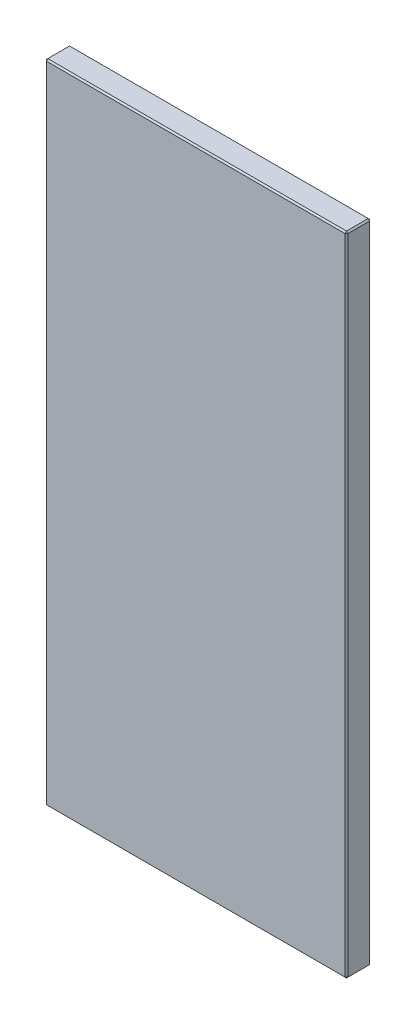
ISO-10303-21;
HEADER;
FILE_DESCRIPTION(('STEP AP214'),'2;1');
FILE_NAME('part.step','',(''),(''),'','','');
FILE_SCHEMA(('AUTOMOTIVE_DESIGN { 1 0 10303 214 1 1 1 1 }'));
ENDSEC;
DATA;
#1=APPLICATION_CONTEXT('core data for automotive mechanical design processes');
#2=APPLICATION_PROTOCOL_DEFINITION('international standard','automotive_design',2000,#1);
#3=PRODUCT_CONTEXT('',#1,'mechanical');
#4=PRODUCT('Part','Part','',(#3));
#5=PRODUCT_RELATED_PRODUCT_CATEGORY('part','',(#4));
#6=PRODUCT_DEFINITION_FORMATION('','',#4);
#7=PRODUCT_DEFINITION_CONTEXT('part definition',#1,'design');
#8=PRODUCT_DEFINITION('design','',#6,#7);
#9=PRODUCT_DEFINITION_SHAPE('','',#8);
#10=(LENGTH_UNIT() NAMED_UNIT(*) SI_UNIT(.MILLI.,.METRE.));
#11=(NAMED_UNIT(*) PLANE_ANGLE_UNIT() SI_UNIT($,.RADIAN.));
#12=(NAMED_UNIT(*) SI_UNIT($,.STERADIAN.) SOLID_ANGLE_UNIT());
#13=UNCERTAINTY_MEASURE_WITH_UNIT(LENGTH_MEASURE(1.E-05),#10,'distance_accuracy_value','');
#14=(GEOMETRIC_REPRESENTATION_CONTEXT(3) GLOBAL_UNCERTAINTY_ASSIGNED_CONTEXT((#13)) GLOBAL_UNIT_ASSIGNED_CONTEXT((#10,
#11,#12)) REPRESENTATION_CONTEXT('',''));
#15=CARTESIAN_POINT('',(0.,0.,0.));
#16=DIRECTION('',(0.,0.,1.));
#17=DIRECTION('',(1.,0.,0.));
#18=AXIS2_PLACEMENT_3D('',#15,#16,#17);
#19=CARTESIAN_POINT('',(-104.,-223.,17.));
#20=DIRECTION('',(1.,0.,0.));
#21=DIRECTION('',(0.,0.,-1.));
#22=AXIS2_PLACEMENT_3D('',#19,#20,#21);
#23=PLANE('',#22);
#24=DIRECTION('',(0.,0.,-1.));
#25=VECTOR('',#24,1.);
#26=CARTESIAN_POINT('',(-104.,222.,17.));
#27=LINE('',#26,#25);
#28=CARTESIAN_POINT('',(-104.,222.,16.));
#29=VERTEX_POINT('',#28);
#30=CARTESIAN_POINT('',(-104.,222.,1.));
#31=VERTEX_POINT('',#30);
#32=EDGE_CURVE('E114',#29,#31,#27,.T.);
#33=ORIENTED_EDGE('',*,*,#32,.T.);
#34=DIRECTION('',(0.,-1.,0.));
#35=VECTOR('',#34,1.);
#36=CARTESIAN_POINT('',(-104.,-223.,1.));
#37=LINE('',#36,#35);
#38=CARTESIAN_POINT('',(-104.,-222.,1.));
#39=VERTEX_POINT('',#38);
#40=EDGE_CURVE('E110',#31,#39,#37,.T.);
#41=ORIENTED_EDGE('',*,*,#40,.T.);
#42=DIRECTION('',(0.,0.,1.));
#43=VECTOR('',#42,1.);
#44=CARTESIAN_POINT('',(-104.,-222.,17.));
#45=LINE('',#44,#43);
#46=CARTESIAN_POINT('',(-104.,-222.,16.));
#47=VERTEX_POINT('',#46);
#48=EDGE_CURVE('E103',#39,#47,#45,.T.);
#49=ORIENTED_EDGE('',*,*,#48,.T.);
#50=DIRECTION('',(0.,1.,0.));
#51=VECTOR('',#50,1.);
#52=CARTESIAN_POINT('',(-104.,223.,16.));
#53=LINE('',#52,#51);
#54=EDGE_CURVE('E107',#47,#29,#53,.T.);
#55=ORIENTED_EDGE('',*,*,#54,.T.);
#56=EDGE_LOOP('',(#33,#41,#49,#55));
#57=FACE_BOUND('',#56,.T.);
#58=ADVANCED_FACE('F15',(#57),#23,.F.);
#59=CARTESIAN_POINT('',(104.,-223.,17.));
#60=DIRECTION('',(0.,1.,0.));
#61=DIRECTION('',(-1.,0.,0.));
#62=AXIS2_PLACEMENT_3D('',#59,#60,#61);
#63=PLANE('',#62);
#64=DIRECTION('',(0.,0.,-1.));
#65=VECTOR('',#64,1.);
#66=CARTESIAN_POINT('',(-103.,-223.,17.));
#67=LINE('',#66,#65);
#68=CARTESIAN_POINT('',(-103.,-223.,16.));
#69=VERTEX_POINT('',#68);
#70=CARTESIAN_POINT('',(-103.,-223.,1.));
#71=VERTEX_POINT('',#70);
#72=EDGE_CURVE('E122',#69,#71,#67,.T.);
#73=ORIENTED_EDGE('',*,*,#72,.T.);
#74=DIRECTION('',(1.,0.,0.));
#75=VECTOR('',#74,1.);
#76=CARTESIAN_POINT('',(104.,-223.,1.));
#77=LINE('',#76,#75);
#78=CARTESIAN_POINT('',(103.,-223.,1.));
#79=VERTEX_POINT('',#78);
#80=EDGE_CURVE('E160',#71,#79,#77,.T.);
#81=ORIENTED_EDGE('',*,*,#80,.T.);
#82=DIRECTION('',(0.,0.,1.));
#83=VECTOR('',#82,1.);
#84=CARTESIAN_POINT('',(103.,-223.,17.));
#85=LINE('',#84,#83);
#86=CARTESIAN_POINT('',(103.,-223.,16.));
#87=VERTEX_POINT('',#86);
#88=EDGE_CURVE('E157',#79,#87,#85,.T.);
#89=ORIENTED_EDGE('',*,*,#88,.T.);
#90=DIRECTION('',(-1.,0.,0.));
#91=VECTOR('',#90,1.);
#92=CARTESIAN_POINT('',(-104.,-223.,16.));
#93=LINE('',#92,#91);
#94=EDGE_CURVE('E155',#87,#69,#93,.T.);
#95=ORIENTED_EDGE('',*,*,#94,.T.);
#96=EDGE_LOOP('',(#73,#81,#89,#95));
#97=FACE_BOUND('',#96,.T.);
#98=ADVANCED_FACE('F277',(#97),#63,.F.);
#99=CARTESIAN_POINT('',(104.,-223.,17.));
#100=DIRECTION('',(-1.,0.,0.));
#101=DIRECTION('',(0.,0.,1.));
#102=AXIS2_PLACEMENT_3D('',#99,#100,#101);
#103=PLANE('',#102);
#104=DIRECTION('',(0.,-1.,0.));
#105=VECTOR('',#104,1.);
#106=CARTESIAN_POINT('',(104.,-223.,16.));
#107=LINE('',#106,#105);
#108=CARTESIAN_POINT('',(104.,222.,16.));
#109=VERTEX_POINT('',#108);
#110=CARTESIAN_POINT('',(104.,-222.,16.));
#111=VERTEX_POINT('',#110);
#112=EDGE_CURVE('E162',#109,#111,#107,.T.);
#113=ORIENTED_EDGE('',*,*,#112,.T.);
#114=DIRECTION('',(0.,0.,-1.));
#115=VECTOR('',#114,1.);
#116=CARTESIAN_POINT('',(104.,-222.,17.));
#117=LINE('',#116,#115);
#118=CARTESIAN_POINT('',(104.,-222.,1.));
#119=VERTEX_POINT('',#118);
#120=EDGE_CURVE('E168',#111,#119,#117,.T.);
#121=ORIENTED_EDGE('',*,*,#120,.T.);
#122=DIRECTION('',(0.,1.,0.));
#123=VECTOR('',#122,1.);
#124=CARTESIAN_POINT('',(104.,-223.,1.));
#125=LINE('',#124,#123);
#126=CARTESIAN_POINT('',(104.,222.,1.));
#127=VERTEX_POINT('',#126);
#128=EDGE_CURVE('E166',#119,#127,#125,.T.);
#129=ORIENTED_EDGE('',*,*,#128,.T.);
#130=DIRECTION('',(0.,0.,1.));
#131=VECTOR('',#130,1.);
#132=CARTESIAN_POINT('',(104.,222.,17.));
#133=LINE('',#132,#131);
#134=EDGE_CURVE('E164',#127,#109,#133,.T.);
#135=ORIENTED_EDGE('',*,*,#134,.T.);
#136=EDGE_LOOP('',(#113,#121,#129,#135));
#137=FACE_BOUND('',#136,.T.);
#138=ADVANCED_FACE('F254',(#137),#103,.F.);
#139=CARTESIAN_POINT('',(104.,223.,17.));
#140=DIRECTION('',(0.,-1.,0.));
#141=DIRECTION('',(1.,0.,0.));
#142=AXIS2_PLACEMENT_3D('',#139,#140,#141);
#143=PLANE('',#142);
#144=DIRECTION('',(-1.,0.,0.));
#145=VECTOR('',#144,1.);
#146=CARTESIAN_POINT('',(104.,223.,1.));
#147=LINE('',#146,#145);
#148=CARTESIAN_POINT('',(103.,223.,1.));
#149=VERTEX_POINT('',#148);
#150=CARTESIAN_POINT('',(-103.,223.,1.));
#151=VERTEX_POINT('',#150);
#152=EDGE_CURVE('E150',#149,#151,#147,.T.);
#153=ORIENTED_EDGE('',*,*,#152,.T.);
#154=DIRECTION('',(0.,0.,1.));
#155=VECTOR('',#154,1.);
#156=CARTESIAN_POINT('',(-103.,223.,17.));
#157=LINE('',#156,#155);
#158=CARTESIAN_POINT('',(-103.,223.,16.));
#159=VERTEX_POINT('',#158);
#160=EDGE_CURVE('E152',#151,#159,#157,.T.);
#161=ORIENTED_EDGE('',*,*,#160,.T.);
#162=DIRECTION('',(1.,0.,0.));
#163=VECTOR('',#162,1.);
#164=CARTESIAN_POINT('',(104.,223.,16.));
#165=LINE('',#164,#163);
#166=CARTESIAN_POINT('',(103.,223.,16.));
#167=VERTEX_POINT('',#166);
#168=EDGE_CURVE('E146',#159,#167,#165,.T.);
#169=ORIENTED_EDGE('',*,*,#168,.T.);
#170=DIRECTION('',(0.,0.,-1.));
#171=VECTOR('',#170,1.);
#172=CARTESIAN_POINT('',(103.,223.,17.));
#173=LINE('',#172,#171);
#174=EDGE_CURVE('E148',#167,#149,#173,.T.);
#175=ORIENTED_EDGE('',*,*,#174,.T.);
#176=EDGE_LOOP('',(#153,#161,#169,#175));
#177=FACE_BOUND('',#176,.T.);
#178=ADVANCED_FACE('F286',(#177),#143,.F.);
#179=CARTESIAN_POINT('',(0.,0.,17.));
#180=DIRECTION('',(0.,0.,1.));
#181=DIRECTION('',(1.,0.,0.));
#182=AXIS2_PLACEMENT_3D('',#179,#180,#181);
#183=PLANE('',#182);
#184=DIRECTION('',(0.,1.,0.));
#185=VECTOR('',#184,1.);
#186=CARTESIAN_POINT('',(103.,223.,17.));
#187=LINE('',#186,#185);
#188=CARTESIAN_POINT('',(103.,-222.,17.));
#189=VERTEX_POINT('',#188);
#190=CARTESIAN_POINT('',(103.,222.,17.));
#191=VERTEX_POINT('',#190);
#192=EDGE_CURVE('E24',#189,#191,#187,.T.);
#193=ORIENTED_EDGE('',*,*,#192,.T.);
#194=DIRECTION('',(-1.,0.,0.));
#195=VECTOR('',#194,1.);
#196=CARTESIAN_POINT('',(-104.,222.,17.));
#197=LINE('',#196,#195);
#198=CARTESIAN_POINT('',(-103.,222.,17.));
#199=VERTEX_POINT('',#198);
#200=EDGE_CURVE('E9',#191,#199,#197,.T.);
#201=ORIENTED_EDGE('',*,*,#200,.T.);
#202=DIRECTION('',(0.,-1.,0.));
#203=VECTOR('',#202,1.);
#204=CARTESIAN_POINT('',(-103.,-223.,17.));
#205=LINE('',#204,#203);
#206=CARTESIAN_POINT('',(-103.,-222.,17.));
#207=VERTEX_POINT('',#206);
#208=EDGE_CURVE('E180',#199,#207,#205,.T.);
#209=ORIENTED_EDGE('',*,*,#208,.T.);
#210=DIRECTION('',(1.,0.,0.));
#211=VECTOR('',#210,1.);
#212=CARTESIAN_POINT('',(104.,-222.,17.));
#213=LINE('',#212,#211);
#214=EDGE_CURVE('E35',#207,#189,#213,.T.);
#215=ORIENTED_EDGE('',*,*,#214,.T.);
#216=EDGE_LOOP('',(#193,#201,#209,#215));
#217=FACE_BOUND('',#216,.T.);
#218=ADVANCED_FACE('F351',(#217),#183,.T.);
#219=CARTESIAN_POINT('',(0.,0.,0.));
#220=DIRECTION('',(0.,0.,1.));
#221=DIRECTION('',(1.,0.,0.));
#222=AXIS2_PLACEMENT_3D('',#219,#220,#221);
#223=PLANE('',#222);
#224=DIRECTION('',(0.,-1.,0.));
#225=VECTOR('',#224,1.);
#226=CARTESIAN_POINT('',(103.,0.,0.));
#227=LINE('',#226,#225);
#228=CARTESIAN_POINT('',(103.,222.,0.));
#229=VERTEX_POINT('',#228);
#230=CARTESIAN_POINT('',(103.,-222.,0.));
#231=VERTEX_POINT('',#230);
#232=EDGE_CURVE('E175',#229,#231,#227,.T.);
#233=ORIENTED_EDGE('',*,*,#232,.T.);
#234=DIRECTION('',(-1.,0.,0.));
#235=VECTOR('',#234,1.);
#236=CARTESIAN_POINT('',(0.,-222.,0.));
#237=LINE('',#236,#235);
#238=CARTESIAN_POINT('',(-103.,-222.,0.));
#239=VERTEX_POINT('',#238);
#240=EDGE_CURVE('E177',#231,#239,#237,.T.);
#241=ORIENTED_EDGE('',*,*,#240,.T.);
#242=DIRECTION('',(0.,1.,0.));
#243=VECTOR('',#242,1.);
#244=CARTESIAN_POINT('',(-103.,0.,0.));
#245=LINE('',#244,#243);
#246=CARTESIAN_POINT('',(-103.,222.,0.));
#247=VERTEX_POINT('',#246);
#248=EDGE_CURVE('E173',#239,#247,#245,.T.);
#249=ORIENTED_EDGE('',*,*,#248,.T.);
#250=DIRECTION('',(1.,0.,0.));
#251=VECTOR('',#250,1.);
#252=CARTESIAN_POINT('',(0.,222.,0.));
#253=LINE('',#252,#251);
#254=EDGE_CURVE('E171',#247,#229,#253,.T.);
#255=ORIENTED_EDGE('',*,*,#254,.T.);
#256=EDGE_LOOP('',(#233,#241,#249,#255));
#257=FACE_BOUND('',#256,.T.);
#258=ADVANCED_FACE('F246',(#257),#223,.F.);
#259=CARTESIAN_POINT('',(104.,-222.,17.));
#260=DIRECTION('',(-0.707106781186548,0.707106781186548,0.));
#261=DIRECTION('',(0.,0.,-1.));
#262=AXIS2_PLACEMENT_3D('',#259,#260,#261);
#263=PLANE('',#262);
#264=DIRECTION('',(-0.707106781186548,-0.707106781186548,0.));
#265=VECTOR('',#264,1.);
#266=CARTESIAN_POINT('',(103.,-223.,16.));
#267=LINE('',#266,#265);
#268=EDGE_CURVE('E19',#87,#111,#267,.F.);
#269=ORIENTED_EDGE('',*,*,#268,.F.);
#270=ORIENTED_EDGE('',*,*,#88,.F.);
#271=DIRECTION('',(0.707106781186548,0.707106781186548,0.));
#272=VECTOR('',#271,1.);
#273=CARTESIAN_POINT('',(104.,-222.,1.));
#274=LINE('',#273,#272);
#275=EDGE_CURVE('E142',#119,#79,#274,.F.);
#276=ORIENTED_EDGE('',*,*,#275,.F.);
#277=ORIENTED_EDGE('',*,*,#120,.F.);
#278=EDGE_LOOP('',(#269,#270,#276,#277));
#279=FACE_BOUND('',#278,.T.);
#280=ADVANCED_FACE('F17',(#279),#263,.F.);
#281=CARTESIAN_POINT('',(103.,-223.,16.));
#282=DIRECTION('',(0.577350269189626,-0.577350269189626,0.577350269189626));
#283=DIRECTION('',(0.707106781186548,0.,-0.707106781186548));
#284=AXIS2_PLACEMENT_3D('',#281,#282,#283);
#285=PLANE('',#284);
#286=DIRECTION('',(0.,-0.707106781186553,-0.707106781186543));
#287=VECTOR('',#286,1.);
#288=CARTESIAN_POINT('',(103.,-223.,16.));
#289=LINE('',#288,#287);
#290=EDGE_CURVE('E227',#87,#189,#289,.F.);
#291=ORIENTED_EDGE('',*,*,#290,.F.);
#292=ORIENTED_EDGE('',*,*,#268,.T.);
#293=DIRECTION('',(-0.707106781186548,0.,0.707106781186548));
#294=VECTOR('',#293,1.);
#295=CARTESIAN_POINT('',(103.5,-222.,16.5));
#296=LINE('',#295,#294);
#297=EDGE_CURVE('E229',#189,#111,#296,.F.);
#298=ORIENTED_EDGE('',*,*,#297,.F.);
#299=EDGE_LOOP('',(#291,#292,#298));
#300=FACE_BOUND('',#299,.T.);
#301=ADVANCED_FACE('F272',(#300),#285,.T.);
#302=CARTESIAN_POINT('',(104.,-222.,1.));
#303=DIRECTION('',(0.57735026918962,-0.57735026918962,-0.577350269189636));
#304=DIRECTION('',(-0.707106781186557,0.,-0.707106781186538));
#305=AXIS2_PLACEMENT_3D('',#302,#303,#304);
#306=PLANE('',#305);
#307=DIRECTION('',(-0.707106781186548,0.,-0.707106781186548));
#308=VECTOR('',#307,1.);
#309=CARTESIAN_POINT('',(104.,-222.,1.));
#310=LINE('',#309,#308);
#311=EDGE_CURVE('E221',#119,#231,#310,.T.);
#312=ORIENTED_EDGE('',*,*,#311,.F.);
#313=ORIENTED_EDGE('',*,*,#275,.T.);
#314=DIRECTION('',(0.,-0.707106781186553,0.707106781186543));
#315=VECTOR('',#314,1.);
#316=CARTESIAN_POINT('',(103.,-222.5,0.500000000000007));
#317=LINE('',#316,#315);
#318=EDGE_CURVE('E224',#231,#79,#317,.T.);
#319=ORIENTED_EDGE('',*,*,#318,.F.);
#320=EDGE_LOOP('',(#312,#313,#319));
#321=FACE_BOUND('',#320,.T.);
#322=ADVANCED_FACE('F236',(#321),#306,.T.);
#323=CARTESIAN_POINT('',(103.,0.,17.));
#324=DIRECTION('',(0.707106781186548,0.,0.707106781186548));
#325=DIRECTION('',(0.,-1.,0.));
#326=AXIS2_PLACEMENT_3D('',#323,#324,#325);
#327=PLANE('',#326);
#328=ORIENTED_EDGE('',*,*,#297,.T.);
#329=ORIENTED_EDGE('',*,*,#112,.F.);
#330=DIRECTION('',(0.707106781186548,0.,-0.707106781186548));
#331=VECTOR('',#330,1.);
#332=CARTESIAN_POINT('',(104.,222.,16.));
#333=LINE('',#332,#331);
#334=EDGE_CURVE('E215',#191,#109,#333,.T.);
#335=ORIENTED_EDGE('',*,*,#334,.F.);
#336=ORIENTED_EDGE('',*,*,#192,.F.);
#337=EDGE_LOOP('',(#328,#329,#335,#336));
#338=FACE_BOUND('',#337,.T.);
#339=ADVANCED_FACE('F267',(#338),#327,.T.);
#340=CARTESIAN_POINT('',(0.,-222.,17.));
#341=DIRECTION('',(0.,-0.707106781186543,0.707106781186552));
#342=DIRECTION('',(-1.,0.,0.));
#343=AXIS2_PLACEMENT_3D('',#340,#341,#342);
#344=PLANE('',#343);
#345=ORIENTED_EDGE('',*,*,#290,.T.);
#346=ORIENTED_EDGE('',*,*,#214,.F.);
#347=DIRECTION('',(0.,0.707106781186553,0.707106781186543));
#348=VECTOR('',#347,1.);
#349=CARTESIAN_POINT('',(-103.,-222.5,16.5));
#350=LINE('',#349,#348);
#351=EDGE_CURVE('E126',#69,#207,#350,.T.);
#352=ORIENTED_EDGE('',*,*,#351,.F.);
#353=ORIENTED_EDGE('',*,*,#94,.F.);
#354=EDGE_LOOP('',(#345,#346,#352,#353));
#355=FACE_BOUND('',#354,.T.);
#356=ADVANCED_FACE('F275',(#355),#344,.T.);
#357=CARTESIAN_POINT('',(-103.,-223.,17.));
#358=DIRECTION('',(0.707106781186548,0.707106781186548,0.));
#359=DIRECTION('',(0.,0.,-1.));
#360=AXIS2_PLACEMENT_3D('',#357,#358,#359);
#361=PLANE('',#360);
#362=DIRECTION('',(0.707106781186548,-0.707106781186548,0.));
#363=VECTOR('',#362,1.);
#364=CARTESIAN_POINT('',(-103.,-223.,1.));
#365=LINE('',#364,#363);
#366=EDGE_CURVE('E127',#71,#39,#365,.F.);
#367=ORIENTED_EDGE('',*,*,#366,.F.);
#368=ORIENTED_EDGE('',*,*,#72,.F.);
#369=DIRECTION('',(-0.707106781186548,0.707106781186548,0.));
#370=VECTOR('',#369,1.);
#371=CARTESIAN_POINT('',(-104.,-222.,16.));
#372=LINE('',#371,#370);
#373=EDGE_CURVE('E118',#47,#69,#372,.F.);
#374=ORIENTED_EDGE('',*,*,#373,.F.);
#375=ORIENTED_EDGE('',*,*,#48,.F.);
#376=EDGE_LOOP('',(#367,#368,#374,#375));
#377=FACE_BOUND('',#376,.T.);
#378=ADVANCED_FACE('F120',(#377),#361,.F.);
#379=CARTESIAN_POINT('',(104.,-223.,1.));
#380=DIRECTION('',(0.,0.707106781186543,0.707106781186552));
#381=DIRECTION('',(1.,0.,0.));
#382=AXIS2_PLACEMENT_3D('',#379,#380,#381);
#383=PLANE('',#382);
#384=ORIENTED_EDGE('',*,*,#318,.T.);
#385=ORIENTED_EDGE('',*,*,#80,.F.);
#386=DIRECTION('',(0.,0.707106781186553,-0.707106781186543));
#387=VECTOR('',#386,1.);
#388=CARTESIAN_POINT('',(-103.,-223.,1.));
#389=LINE('',#388,#387);
#390=EDGE_CURVE('E211',#239,#71,#389,.F.);
#391=ORIENTED_EDGE('',*,*,#390,.F.);
#392=ORIENTED_EDGE('',*,*,#240,.F.);
#393=EDGE_LOOP('',(#384,#385,#391,#392));
#394=FACE_BOUND('',#393,.T.);
#395=ADVANCED_FACE('F243',(#394),#383,.F.);
#396=CARTESIAN_POINT('',(104.,-223.,1.));
#397=DIRECTION('',(-0.707106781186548,0.,0.707106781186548));
#398=DIRECTION('',(0.,1.,0.));
#399=AXIS2_PLACEMENT_3D('',#396,#397,#398);
#400=PLANE('',#399);
#401=ORIENTED_EDGE('',*,*,#311,.T.);
#402=ORIENTED_EDGE('',*,*,#232,.F.);
#403=DIRECTION('',(0.707106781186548,0.,0.707106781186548));
#404=VECTOR('',#403,1.);
#405=CARTESIAN_POINT('',(104.,222.,1.));
#406=LINE('',#405,#404);
#407=EDGE_CURVE('E208',#127,#229,#406,.F.);
#408=ORIENTED_EDGE('',*,*,#407,.F.);
#409=ORIENTED_EDGE('',*,*,#128,.F.);
#410=EDGE_LOOP('',(#401,#402,#408,#409));
#411=FACE_BOUND('',#410,.T.);
#412=ADVANCED_FACE('F251',(#411),#400,.F.);
#413=CARTESIAN_POINT('',(103.,223.,17.));
#414=DIRECTION('',(-0.707106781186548,-0.707106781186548,0.));
#415=DIRECTION('',(0.,0.,-1.));
#416=AXIS2_PLACEMENT_3D('',#413,#414,#415);
#417=PLANE('',#416);
#418=DIRECTION('',(0.707106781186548,-0.707106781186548,0.));
#419=VECTOR('',#418,1.);
#420=CARTESIAN_POINT('',(104.,222.,16.));
#421=LINE('',#420,#419);
#422=EDGE_CURVE('E218',#109,#167,#421,.F.);
#423=ORIENTED_EDGE('',*,*,#422,.F.);
#424=ORIENTED_EDGE('',*,*,#134,.F.);
#425=DIRECTION('',(-0.707106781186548,0.707106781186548,0.));
#426=VECTOR('',#425,1.);
#427=CARTESIAN_POINT('',(104.,222.,1.));
#428=LINE('',#427,#426);
#429=EDGE_CURVE('E205',#149,#127,#428,.F.);
#430=ORIENTED_EDGE('',*,*,#429,.F.);
#431=ORIENTED_EDGE('',*,*,#174,.F.);
#432=EDGE_LOOP('',(#423,#424,#430,#431));
#433=FACE_BOUND('',#432,.T.);
#434=ADVANCED_FACE('F259',(#433),#417,.F.);
#435=CARTESIAN_POINT('',(104.,222.,16.));
#436=DIRECTION('',(0.577350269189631,0.577350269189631,0.577350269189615));
#437=DIRECTION('',(-0.707106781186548,0.707106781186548,0.));
#438=AXIS2_PLACEMENT_3D('',#435,#436,#437);
#439=PLANE('',#438);
#440=ORIENTED_EDGE('',*,*,#334,.T.);
#441=ORIENTED_EDGE('',*,*,#422,.T.);
#442=DIRECTION('',(0.,-0.707106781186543,0.707106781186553));
#443=VECTOR('',#442,1.);
#444=CARTESIAN_POINT('',(103.,222.5,16.5));
#445=LINE('',#444,#443);
#446=EDGE_CURVE('E134',#191,#167,#445,.F.);
#447=ORIENTED_EDGE('',*,*,#446,.F.);
#448=EDGE_LOOP('',(#440,#441,#447));
#449=FACE_BOUND('',#448,.T.);
#450=ADVANCED_FACE('F264',(#449),#439,.T.);
#451=CARTESIAN_POINT('',(-104.,-222.,16.));
#452=DIRECTION('',(-0.577350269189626,-0.577350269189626,0.577350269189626));
#453=DIRECTION('',(0.707106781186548,0.,0.707106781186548));
#454=AXIS2_PLACEMENT_3D('',#451,#452,#453);
#455=PLANE('',#454);
#456=ORIENTED_EDGE('',*,*,#373,.T.);
#457=ORIENTED_EDGE('',*,*,#351,.T.);
#458=DIRECTION('',(-0.707106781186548,0.,-0.707106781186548));
#459=VECTOR('',#458,1.);
#460=CARTESIAN_POINT('',(-104.,-222.,16.));
#461=LINE('',#460,#459);
#462=EDGE_CURVE('E130',#47,#207,#461,.F.);
#463=ORIENTED_EDGE('',*,*,#462,.F.);
#464=EDGE_LOOP('',(#456,#457,#463));
#465=FACE_BOUND('',#464,.T.);
#466=ADVANCED_FACE('F131',(#465),#455,.T.);
#467=CARTESIAN_POINT('',(-103.,-223.,1.));
#468=DIRECTION('',(-0.57735026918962,-0.57735026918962,-0.577350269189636));
#469=DIRECTION('',(-0.707106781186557,0.,0.707106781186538));
#470=AXIS2_PLACEMENT_3D('',#467,#468,#469);
#471=PLANE('',#470);
#472=ORIENTED_EDGE('',*,*,#390,.T.);
#473=ORIENTED_EDGE('',*,*,#366,.T.);
#474=DIRECTION('',(-0.707106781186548,0.,0.707106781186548));
#475=VECTOR('',#474,1.);
#476=CARTESIAN_POINT('',(-103.5,-222.,0.500000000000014));
#477=LINE('',#476,#475);
#478=EDGE_CURVE('E135',#239,#39,#477,.T.);
#479=ORIENTED_EDGE('',*,*,#478,.F.);
#480=EDGE_LOOP('',(#472,#473,#479));
#481=FACE_BOUND('',#480,.T.);
#482=ADVANCED_FACE('F320',(#481),#471,.T.);
#483=CARTESIAN_POINT('',(104.,222.,1.));
#484=DIRECTION('',(0.577350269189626,0.577350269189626,-0.577350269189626));
#485=DIRECTION('',(-0.707106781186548,0.,-0.707106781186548));
#486=AXIS2_PLACEMENT_3D('',#483,#484,#485);
#487=PLANE('',#486);
#488=ORIENTED_EDGE('',*,*,#429,.T.);
#489=ORIENTED_EDGE('',*,*,#407,.T.);
#490=DIRECTION('',(0.,-0.707106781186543,-0.707106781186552));
#491=VECTOR('',#490,1.);
#492=CARTESIAN_POINT('',(103.,222.5,0.500000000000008));
#493=LINE('',#492,#491);
#494=EDGE_CURVE('E198',#149,#229,#493,.T.);
#495=ORIENTED_EDGE('',*,*,#494,.F.);
#496=EDGE_LOOP('',(#488,#489,#495));
#497=FACE_BOUND('',#496,.T.);
#498=ADVANCED_FACE('F316',(#497),#487,.T.);
#499=CARTESIAN_POINT('',(0.,222.,17.));
#500=DIRECTION('',(0.,0.707106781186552,0.707106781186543));
#501=DIRECTION('',(1.,0.,0.));
#502=AXIS2_PLACEMENT_3D('',#499,#500,#501);
#503=PLANE('',#502);
#504=ORIENTED_EDGE('',*,*,#446,.T.);
#505=ORIENTED_EDGE('',*,*,#168,.F.);
#506=DIRECTION('',(0.,0.707106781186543,-0.707106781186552));
#507=VECTOR('',#506,1.);
#508=CARTESIAN_POINT('',(-103.,223.,16.));
#509=LINE('',#508,#507);
#510=EDGE_CURVE('E195',#199,#159,#509,.T.);
#511=ORIENTED_EDGE('',*,*,#510,.F.);
#512=ORIENTED_EDGE('',*,*,#200,.F.);
#513=EDGE_LOOP('',(#504,#505,#511,#512));
#514=FACE_BOUND('',#513,.T.);
#515=ADVANCED_FACE('F313',(#514),#503,.T.);
#516=CARTESIAN_POINT('',(-103.,0.,17.));
#517=DIRECTION('',(-0.707106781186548,0.,0.707106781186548));
#518=DIRECTION('',(0.,1.,0.));
#519=AXIS2_PLACEMENT_3D('',#516,#517,#518);
#520=PLANE('',#519);
#521=ORIENTED_EDGE('',*,*,#462,.T.);
#522=ORIENTED_EDGE('',*,*,#208,.F.);
#523=DIRECTION('',(0.707106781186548,0.,0.707106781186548));
#524=VECTOR('',#523,1.);
#525=CARTESIAN_POINT('',(-103.5,222.,16.5));
#526=LINE('',#525,#524);
#527=EDGE_CURVE('E138',#29,#199,#526,.T.);
#528=ORIENTED_EDGE('',*,*,#527,.F.);
#529=ORIENTED_EDGE('',*,*,#54,.F.);
#530=EDGE_LOOP('',(#521,#522,#528,#529));
#531=FACE_BOUND('',#530,.T.);
#532=ADVANCED_FACE('F137',(#531),#520,.T.);
#533=CARTESIAN_POINT('',(-104.,-223.,1.));
#534=DIRECTION('',(0.707106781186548,0.,0.707106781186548));
#535=DIRECTION('',(0.,-1.,0.));
#536=AXIS2_PLACEMENT_3D('',#533,#534,#535);
#537=PLANE('',#536);
#538=ORIENTED_EDGE('',*,*,#478,.T.);
#539=ORIENTED_EDGE('',*,*,#40,.F.);
#540=DIRECTION('',(0.707106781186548,0.,-0.707106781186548));
#541=VECTOR('',#540,1.);
#542=CARTESIAN_POINT('',(-104.,222.,1.));
#543=LINE('',#542,#541);
#544=EDGE_CURVE('E191',#247,#31,#543,.F.);
#545=ORIENTED_EDGE('',*,*,#544,.F.);
#546=ORIENTED_EDGE('',*,*,#248,.F.);
#547=EDGE_LOOP('',(#538,#539,#545,#546));
#548=FACE_BOUND('',#547,.T.);
#549=ADVANCED_FACE('F306',(#548),#537,.F.);
#550=CARTESIAN_POINT('',(104.,223.,1.));
#551=DIRECTION('',(0.,-0.707106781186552,0.707106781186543));
#552=DIRECTION('',(-1.,0.,0.));
#553=AXIS2_PLACEMENT_3D('',#550,#551,#552);
#554=PLANE('',#553);
#555=ORIENTED_EDGE('',*,*,#494,.T.);
#556=ORIENTED_EDGE('',*,*,#254,.F.);
#557=DIRECTION('',(0.,0.707106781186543,0.707106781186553));
#558=VECTOR('',#557,1.);
#559=CARTESIAN_POINT('',(-103.,222.5,0.500000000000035));
#560=LINE('',#559,#558);
#561=EDGE_CURVE('E188',#151,#247,#560,.F.);
#562=ORIENTED_EDGE('',*,*,#561,.F.);
#563=ORIENTED_EDGE('',*,*,#152,.F.);
#564=EDGE_LOOP('',(#555,#556,#562,#563));
#565=FACE_BOUND('',#564,.T.);
#566=ADVANCED_FACE('F302',(#565),#554,.F.);
#567=CARTESIAN_POINT('',(-103.,223.,16.));
#568=DIRECTION('',(-0.57735026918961,0.577350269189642,0.577350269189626));
#569=DIRECTION('',(0.,-0.707106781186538,0.707106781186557));
#570=AXIS2_PLACEMENT_3D('',#567,#568,#569);
#571=PLANE('',#570);
#572=ORIENTED_EDGE('',*,*,#527,.T.);
#573=ORIENTED_EDGE('',*,*,#510,.T.);
#574=DIRECTION('',(0.707106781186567,0.707106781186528,0.));
#575=VECTOR('',#574,1.);
#576=CARTESIAN_POINT('',(-103.,223.,16.));
#577=LINE('',#576,#575);
#578=EDGE_CURVE('E186',#29,#159,#577,.T.);
#579=ORIENTED_EDGE('',*,*,#578,.F.);
#580=EDGE_LOOP('',(#572,#573,#579));
#581=FACE_BOUND('',#580,.T.);
#582=ADVANCED_FACE('F298',(#581),#571,.T.);
#583=CARTESIAN_POINT('',(-104.,222.,1.));
#584=DIRECTION('',(-0.577350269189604,0.577350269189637,-0.577350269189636));
#585=DIRECTION('',(0.,0.707106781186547,0.707106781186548));
#586=AXIS2_PLACEMENT_3D('',#583,#584,#585);
#587=PLANE('',#586);
#588=ORIENTED_EDGE('',*,*,#561,.T.);
#589=ORIENTED_EDGE('',*,*,#544,.T.);
#590=DIRECTION('',(-0.707106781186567,-0.707106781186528,0.));
#591=VECTOR('',#590,1.);
#592=CARTESIAN_POINT('',(-104.,222.,1.));
#593=LINE('',#592,#591);
#594=EDGE_CURVE('E184',#151,#31,#593,.T.);
#595=ORIENTED_EDGE('',*,*,#594,.F.);
#596=EDGE_LOOP('',(#588,#589,#595));
#597=FACE_BOUND('',#596,.T.);
#598=ADVANCED_FACE('F294',(#597),#587,.T.);
#599=CARTESIAN_POINT('',(-104.,222.,17.));
#600=DIRECTION('',(0.707106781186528,-0.707106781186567,0.));
#601=DIRECTION('',(0.,0.,-1.));
#602=AXIS2_PLACEMENT_3D('',#599,#600,#601);
#603=PLANE('',#602);
#604=ORIENTED_EDGE('',*,*,#578,.T.);
#605=ORIENTED_EDGE('',*,*,#160,.F.);
#606=ORIENTED_EDGE('',*,*,#594,.T.);
#607=ORIENTED_EDGE('',*,*,#32,.F.);
#608=EDGE_LOOP('',(#604,#605,#606,#607));
#609=FACE_BOUND('',#608,.T.);
#610=ADVANCED_FACE('F291',(#609),#603,.F.);
#611=CLOSED_SHELL('',(#58,#98,#138,#178,#218,#258,#280,#301,#322,#339,#356,#378,#395,#412,#434,
#450,#466,#482,#498,#515,#532,#549,#566,#582,#598,#610));
#612=MANIFOLD_SOLID_BREP('B1',#611);
#613=ADVANCED_BREP_SHAPE_REPRESENTATION('',(#18,#612),#14);
#614=SHAPE_DEFINITION_REPRESENTATION(#9,#613);
ENDSEC;
END-ISO-10303-21;
